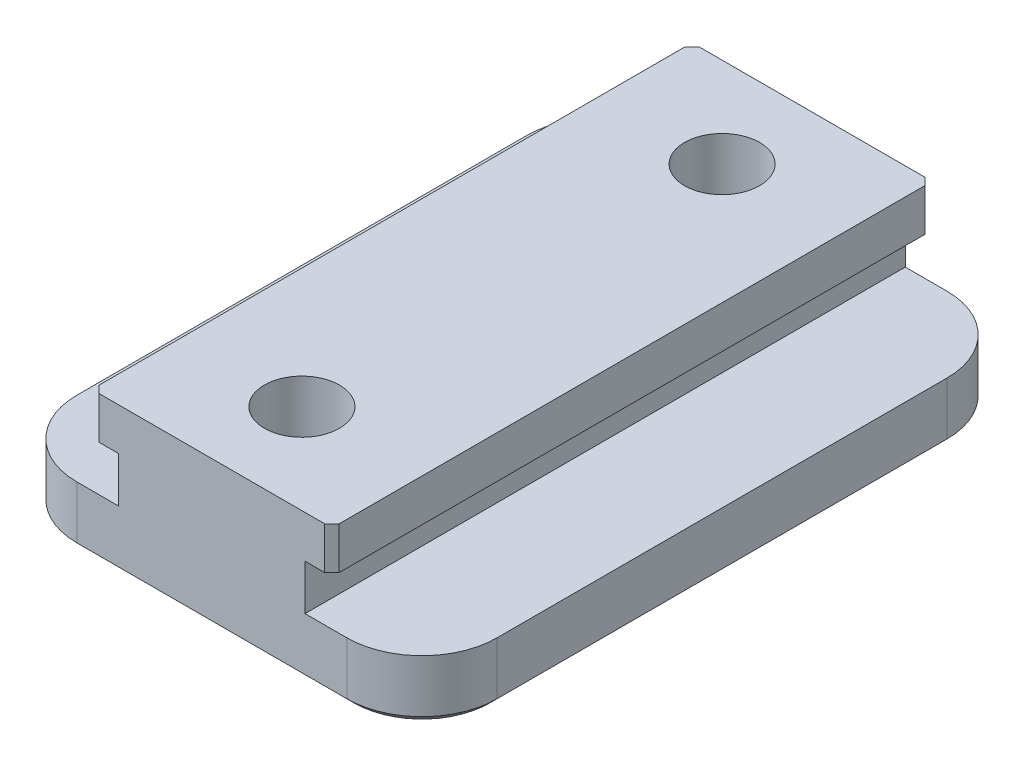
ISO-10303-21;
HEADER;
FILE_DESCRIPTION(('STEP AP214'),'2;1');
FILE_NAME('part.step','',(''),(''),'','','');
FILE_SCHEMA(('AUTOMOTIVE_DESIGN { 1 0 10303 214 1 1 1 1 }'));
ENDSEC;
DATA;
#1=APPLICATION_CONTEXT('core data for automotive mechanical design processes');
#2=APPLICATION_PROTOCOL_DEFINITION('international standard','automotive_design',2000,#1);
#3=PRODUCT_CONTEXT('',#1,'mechanical');
#4=PRODUCT('Part','Part','',(#3));
#5=PRODUCT_RELATED_PRODUCT_CATEGORY('part','',(#4));
#6=PRODUCT_DEFINITION_FORMATION('','',#4);
#7=PRODUCT_DEFINITION_CONTEXT('part definition',#1,'design');
#8=PRODUCT_DEFINITION('design','',#6,#7);
#9=PRODUCT_DEFINITION_SHAPE('','',#8);
#10=(LENGTH_UNIT() NAMED_UNIT(*) SI_UNIT(.MILLI.,.METRE.));
#11=(NAMED_UNIT(*) PLANE_ANGLE_UNIT() SI_UNIT($,.RADIAN.));
#12=(NAMED_UNIT(*) SI_UNIT($,.STERADIAN.) SOLID_ANGLE_UNIT());
#13=UNCERTAINTY_MEASURE_WITH_UNIT(LENGTH_MEASURE(1.E-05),#10,'distance_accuracy_value','');
#14=(GEOMETRIC_REPRESENTATION_CONTEXT(3) GLOBAL_UNCERTAINTY_ASSIGNED_CONTEXT((#13)) GLOBAL_UNIT_ASSIGNED_CONTEXT((#10,
#11,#12)) REPRESENTATION_CONTEXT('',''));
#15=CARTESIAN_POINT('',(0.,0.,0.));
#16=DIRECTION('',(0.,0.,1.));
#17=DIRECTION('',(1.,0.,0.));
#18=AXIS2_PLACEMENT_3D('',#15,#16,#17);
#19=CARTESIAN_POINT('',(-22.225,-9.525,31.75));
#20=DIRECTION('',(0.,1.,0.));
#21=DIRECTION('',(0.,0.,1.));
#22=AXIS2_PLACEMENT_3D('',#19,#20,#21);
#23=PLANE('',#22);
#24=CARTESIAN_POINT('',(0.,-9.525,-22.225));
#25=DIRECTION('',(0.,-1.,0.));
#26=DIRECTION('',(0.,0.,-1.));
#27=AXIS2_PLACEMENT_3D('',#24,#25,#26);
#28=CIRCLE('',#27,3.96875);
#29=CARTESIAN_POINT('',(0.,-9.525,-26.19375));
#30=VERTEX_POINT('',#29);
#31=EDGE_CURVE('E836',#30,#30,#28,.T.);
#32=ORIENTED_EDGE('',*,*,#31,.F.);
#33=EDGE_LOOP('',(#32));
#34=FACE_BOUND('',#33,.T.);
#35=CARTESIAN_POINT('',(-14.2748,-9.525,-23.7998));
#36=DIRECTION('',(0.,1.,0.));
#37=DIRECTION('',(0.,0.,1.));
#38=AXIS2_PLACEMENT_3D('',#35,#36,#37);
#39=CIRCLE('',#38,7.1882);
#40=CARTESIAN_POINT('',(-21.463,-9.525,-23.7998));
#41=VERTEX_POINT('',#40);
#42=CARTESIAN_POINT('',(-14.2748,-9.525,-30.988));
#43=VERTEX_POINT('',#42);
#44=EDGE_CURVE('E318',#41,#43,#39,.F.);
#45=ORIENTED_EDGE('',*,*,#44,.T.);
#46=DIRECTION('',(1.,0.,0.));
#47=VECTOR('',#46,1.);
#48=CARTESIAN_POINT('',(-22.225,-9.525,-30.988));
#49=LINE('',#48,#47);
#50=CARTESIAN_POINT('',(14.2748,-9.525,-30.988));
#51=VERTEX_POINT('',#50);
#52=EDGE_CURVE('E320',#43,#51,#49,.T.);
#53=ORIENTED_EDGE('',*,*,#52,.T.);
#54=CARTESIAN_POINT('',(14.2748,-9.525,-23.7998));
#55=DIRECTION('',(0.,1.,0.));
#56=DIRECTION('',(0.,0.,1.));
#57=AXIS2_PLACEMENT_3D('',#54,#55,#56);
#58=CIRCLE('',#57,7.1882);
#59=CARTESIAN_POINT('',(21.463,-9.525,-23.7998));
#60=VERTEX_POINT('',#59);
#61=EDGE_CURVE('E316',#51,#60,#58,.F.);
#62=ORIENTED_EDGE('',*,*,#61,.T.);
#63=DIRECTION('',(0.,0.,1.));
#64=VECTOR('',#63,1.);
#65=CARTESIAN_POINT('',(21.463,-9.525,31.75));
#66=LINE('',#65,#64);
#67=CARTESIAN_POINT('',(21.463,-9.525,23.7998));
#68=VERTEX_POINT('',#67);
#69=EDGE_CURVE('E312',#60,#68,#66,.T.);
#70=ORIENTED_EDGE('',*,*,#69,.T.);
#71=CARTESIAN_POINT('',(14.2748,-9.525,23.7998));
#72=DIRECTION('',(0.,1.,0.));
#73=DIRECTION('',(0.,0.,1.));
#74=AXIS2_PLACEMENT_3D('',#71,#72,#73);
#75=CIRCLE('',#74,7.1882);
#76=CARTESIAN_POINT('',(14.2748,-9.525,30.988));
#77=VERTEX_POINT('',#76);
#78=EDGE_CURVE('E308',#68,#77,#75,.F.);
#79=ORIENTED_EDGE('',*,*,#78,.T.);
#80=DIRECTION('',(-1.,0.,0.));
#81=VECTOR('',#80,1.);
#82=CARTESIAN_POINT('',(-14.2748,-9.525,30.988));
#83=LINE('',#82,#81);
#84=CARTESIAN_POINT('',(-14.2748,-9.525,30.988));
#85=VERTEX_POINT('',#84);
#86=EDGE_CURVE('E306',#77,#85,#83,.T.);
#87=ORIENTED_EDGE('',*,*,#86,.T.);
#88=CARTESIAN_POINT('',(-14.2748,-9.525,23.7998));
#89=DIRECTION('',(0.,1.,0.));
#90=DIRECTION('',(0.,0.,1.));
#91=AXIS2_PLACEMENT_3D('',#88,#89,#90);
#92=CIRCLE('',#91,7.1882);
#93=CARTESIAN_POINT('',(-21.463,-9.525,23.7998));
#94=VERTEX_POINT('',#93);
#95=EDGE_CURVE('E310',#85,#94,#92,.F.);
#96=ORIENTED_EDGE('',*,*,#95,.T.);
#97=DIRECTION('',(0.,0.,-1.));
#98=VECTOR('',#97,1.);
#99=CARTESIAN_POINT('',(-21.463,-9.525,31.75));
#100=LINE('',#99,#98);
#101=EDGE_CURVE('E314',#94,#41,#100,.T.);
#102=ORIENTED_EDGE('',*,*,#101,.T.);
#103=EDGE_LOOP('',(#45,#53,#62,#70,#79,#87,#96,#102));
#104=FACE_BOUND('',#103,.T.);
#105=CARTESIAN_POINT('',(0.,-9.525,22.225));
#106=DIRECTION('',(0.,-1.,0.));
#107=DIRECTION('',(0.,0.,-1.));
#108=AXIS2_PLACEMENT_3D('',#105,#106,#107);
#109=CIRCLE('',#108,3.96875);
#110=CARTESIAN_POINT('',(0.,-9.525,18.25625));
#111=VERTEX_POINT('',#110);
#112=EDGE_CURVE('E841',#111,#111,#109,.T.);
#113=ORIENTED_EDGE('',*,*,#112,.F.);
#114=EDGE_LOOP('',(#113));
#115=FACE_BOUND('',#114,.T.);
#116=ADVANCED_FACE('F39',(#34,#104,#115),#23,.F.);
#117=CARTESIAN_POINT('',(-12.7,6.096,31.75));
#118=DIRECTION('',(1.,0.,0.));
#119=DIRECTION('',(0.,0.,-1.));
#120=AXIS2_PLACEMENT_3D('',#117,#118,#119);
#121=PLANE('',#120);
#122=DIRECTION('',(0.,0.,-1.));
#123=VECTOR('',#122,1.);
#124=CARTESIAN_POINT('',(-12.7,6.096,31.75));
#125=LINE('',#124,#123);
#126=CARTESIAN_POINT('',(-12.7,6.096,30.988));
#127=VERTEX_POINT('',#126);
#128=CARTESIAN_POINT('',(-12.7,6.096,-30.988));
#129=VERTEX_POINT('',#128);
#130=EDGE_CURVE('E239',#127,#129,#125,.T.);
#131=ORIENTED_EDGE('',*,*,#130,.T.);
#132=DIRECTION('',(0.,-1.,0.));
#133=VECTOR('',#132,1.);
#134=CARTESIAN_POINT('',(-12.7,6.096,-30.988));
#135=LINE('',#134,#133);
#136=CARTESIAN_POINT('',(-12.7,1.6256,-30.988));
#137=VERTEX_POINT('',#136);
#138=EDGE_CURVE('E385',#129,#137,#135,.T.);
#139=ORIENTED_EDGE('',*,*,#138,.T.);
#140=DIRECTION('',(0.,0.,-1.));
#141=VECTOR('',#140,1.);
#142=CARTESIAN_POINT('',(-12.7,1.6256,31.75));
#143=LINE('',#142,#141);
#144=CARTESIAN_POINT('',(-12.7,1.6256,30.988));
#145=VERTEX_POINT('',#144);
#146=EDGE_CURVE('E219',#145,#137,#143,.T.);
#147=ORIENTED_EDGE('',*,*,#146,.F.);
#148=DIRECTION('',(0.,1.,0.));
#149=VECTOR('',#148,1.);
#150=CARTESIAN_POINT('',(-12.7,6.096,30.988));
#151=LINE('',#150,#149);
#152=EDGE_CURVE('E383',#145,#127,#151,.T.);
#153=ORIENTED_EDGE('',*,*,#152,.T.);
#154=EDGE_LOOP('',(#131,#139,#147,#153));
#155=FACE_BOUND('',#154,.T.);
#156=ADVANCED_FACE('F402',(#155),#121,.F.);
#157=CARTESIAN_POINT('',(-12.7,1.6256,31.75));
#158=DIRECTION('',(0.,1.,0.));
#159=DIRECTION('',(-1.,0.,0.));
#160=AXIS2_PLACEMENT_3D('',#157,#158,#159);
#161=PLANE('',#160);
#162=ORIENTED_EDGE('',*,*,#146,.T.);
#163=DIRECTION('',(-0.707106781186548,0.,0.707106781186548));
#164=VECTOR('',#163,1.);
#165=CARTESIAN_POINT('',(-12.7,1.6256,-30.988));
#166=LINE('',#165,#164);
#167=CARTESIAN_POINT('',(-11.938,1.6256,-31.75));
#168=VERTEX_POINT('',#167);
#169=EDGE_CURVE('E61',#137,#168,#166,.F.);
#170=ORIENTED_EDGE('',*,*,#169,.T.);
#171=DIRECTION('',(1.,0.,0.));
#172=VECTOR('',#171,1.);
#173=CARTESIAN_POINT('',(-12.7,1.6256,-31.75));
#174=LINE('',#173,#172);
#175=CARTESIAN_POINT('',(-9.8552,1.6256,-31.75));
#176=VERTEX_POINT('',#175);
#177=EDGE_CURVE('E216',#168,#176,#174,.T.);
#178=ORIENTED_EDGE('',*,*,#177,.T.);
#179=DIRECTION('',(0.,0.,-1.));
#180=VECTOR('',#179,1.);
#181=CARTESIAN_POINT('',(-9.8552,1.6256,31.75));
#182=LINE('',#181,#180);
#183=CARTESIAN_POINT('',(-9.8552,1.6256,31.75));
#184=VERTEX_POINT('',#183);
#185=EDGE_CURVE('E212',#184,#176,#182,.T.);
#186=ORIENTED_EDGE('',*,*,#185,.F.);
#187=DIRECTION('',(1.,0.,0.));
#188=VECTOR('',#187,1.);
#189=CARTESIAN_POINT('',(-12.7,1.6256,31.75));
#190=LINE('',#189,#188);
#191=CARTESIAN_POINT('',(-11.938,1.6256,31.75));
#192=VERTEX_POINT('',#191);
#193=EDGE_CURVE('E200',#192,#184,#190,.T.);
#194=ORIENTED_EDGE('',*,*,#193,.F.);
#195=DIRECTION('',(-0.707106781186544,0.,-0.707106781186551));
#196=VECTOR('',#195,1.);
#197=CARTESIAN_POINT('',(-11.938,1.6256,31.75));
#198=LINE('',#197,#196);
#199=EDGE_CURVE('E54',#192,#145,#198,.T.);
#200=ORIENTED_EDGE('',*,*,#199,.T.);
#201=EDGE_LOOP('',(#162,#170,#178,#186,#194,#200));
#202=FACE_BOUND('',#201,.T.);
#203=ADVANCED_FACE('F214',(#202),#161,.F.);
#204=CARTESIAN_POINT('',(-9.8552,1.6256,31.75));
#205=DIRECTION('',(1.,0.,0.));
#206=DIRECTION('',(0.,1.,0.));
#207=AXIS2_PLACEMENT_3D('',#204,#205,#206);
#208=PLANE('',#207);
#209=DIRECTION('',(0.,-1.,0.));
#210=VECTOR('',#209,1.);
#211=CARTESIAN_POINT('',(-9.8552,1.6256,-31.75));
#212=LINE('',#211,#210);
#213=CARTESIAN_POINT('',(-9.8552,-3.175,-31.75));
#214=VERTEX_POINT('',#213);
#215=EDGE_CURVE('E241',#176,#214,#212,.T.);
#216=ORIENTED_EDGE('',*,*,#215,.T.);
#217=DIRECTION('',(0.,0.,-1.));
#218=VECTOR('',#217,1.);
#219=CARTESIAN_POINT('',(-9.8552,-3.175,31.75));
#220=LINE('',#219,#218);
#221=CARTESIAN_POINT('',(-9.8552,-3.175,31.75));
#222=VERTEX_POINT('',#221);
#223=EDGE_CURVE('E220',#222,#214,#220,.T.);
#224=ORIENTED_EDGE('',*,*,#223,.F.);
#225=DIRECTION('',(0.,-1.,0.));
#226=VECTOR('',#225,1.);
#227=CARTESIAN_POINT('',(-9.8552,1.6256,31.75));
#228=LINE('',#227,#226);
#229=EDGE_CURVE('E206',#184,#222,#228,.T.);
#230=ORIENTED_EDGE('',*,*,#229,.F.);
#231=ORIENTED_EDGE('',*,*,#185,.T.);
#232=EDGE_LOOP('',(#216,#224,#230,#231));
#233=FACE_BOUND('',#232,.T.);
#234=ADVANCED_FACE('F222',(#233),#208,.F.);
#235=CARTESIAN_POINT('',(-9.8552,-3.175,31.75));
#236=DIRECTION('',(0.,-1.,0.));
#237=DIRECTION('',(1.,0.,0.));
#238=AXIS2_PLACEMENT_3D('',#235,#236,#237);
#239=PLANE('',#238);
#240=DIRECTION('',(0.,0.,-1.));
#241=VECTOR('',#240,1.);
#242=CARTESIAN_POINT('',(-22.225,-3.175,31.75));
#243=LINE('',#242,#241);
#244=CARTESIAN_POINT('',(-22.225,-3.175,23.7998));
#245=VERTEX_POINT('',#244);
#246=CARTESIAN_POINT('',(-22.225,-3.175,-23.7998));
#247=VERTEX_POINT('',#246);
#248=EDGE_CURVE('E273',#245,#247,#243,.T.);
#249=ORIENTED_EDGE('',*,*,#248,.F.);
#250=CARTESIAN_POINT('',(-14.2748,-3.175,23.7998));
#251=DIRECTION('',(0.,-1.,0.));
#252=DIRECTION('',(1.,0.,0.));
#253=AXIS2_PLACEMENT_3D('',#250,#251,#252);
#254=CIRCLE('',#253,7.9502);
#255=CARTESIAN_POINT('',(-14.2748,-3.175,31.75));
#256=VERTEX_POINT('',#255);
#257=EDGE_CURVE('E290',#245,#256,#254,.F.);
#258=ORIENTED_EDGE('',*,*,#257,.T.);
#259=DIRECTION('',(-1.,0.,0.));
#260=VECTOR('',#259,1.);
#261=CARTESIAN_POINT('',(-9.8552,-3.175,31.75));
#262=LINE('',#261,#260);
#263=EDGE_CURVE('E225',#222,#256,#262,.T.);
#264=ORIENTED_EDGE('',*,*,#263,.F.);
#265=ORIENTED_EDGE('',*,*,#223,.T.);
#266=DIRECTION('',(-1.,0.,0.));
#267=VECTOR('',#266,1.);
#268=CARTESIAN_POINT('',(-9.8552,-3.175,-31.75));
#269=LINE('',#268,#267);
#270=CARTESIAN_POINT('',(-14.2748,-3.175,-31.75));
#271=VERTEX_POINT('',#270);
#272=EDGE_CURVE('E244',#214,#271,#269,.T.);
#273=ORIENTED_EDGE('',*,*,#272,.T.);
#274=CARTESIAN_POINT('',(-14.2748,-3.175,-23.7998));
#275=DIRECTION('',(0.,-1.,0.));
#276=DIRECTION('',(1.,0.,0.));
#277=AXIS2_PLACEMENT_3D('',#274,#275,#276);
#278=CIRCLE('',#277,7.9502);
#279=EDGE_CURVE('E288',#271,#247,#278,.F.);
#280=ORIENTED_EDGE('',*,*,#279,.T.);
#281=EDGE_LOOP('',(#249,#258,#264,#265,#273,#280));
#282=FACE_BOUND('',#281,.T.);
#283=ADVANCED_FACE('F520',(#282),#239,.F.);
#284=CARTESIAN_POINT('',(-22.225,-3.175,31.75));
#285=DIRECTION('',(1.,0.,0.));
#286=DIRECTION('',(0.,0.,-1.));
#287=AXIS2_PLACEMENT_3D('',#284,#285,#286);
#288=PLANE('',#287);
#289=DIRECTION('',(0.,-1.,0.));
#290=VECTOR('',#289,1.);
#291=CARTESIAN_POINT('',(-22.225,-3.175,-23.7998));
#292=LINE('',#291,#290);
#293=CARTESIAN_POINT('',(-22.225,-8.763,-23.7998));
#294=VERTEX_POINT('',#293);
#295=EDGE_CURVE('E283',#247,#294,#292,.T.);
#296=ORIENTED_EDGE('',*,*,#295,.T.);
#297=DIRECTION('',(0.,0.,1.));
#298=VECTOR('',#297,1.);
#299=CARTESIAN_POINT('',(-22.225,-8.763,31.75));
#300=LINE('',#299,#298);
#301=CARTESIAN_POINT('',(-22.225,-8.763,23.7998));
#302=VERTEX_POINT('',#301);
#303=EDGE_CURVE('E330',#294,#302,#300,.T.);
#304=ORIENTED_EDGE('',*,*,#303,.T.);
#305=DIRECTION('',(0.,-1.,0.));
#306=VECTOR('',#305,1.);
#307=CARTESIAN_POINT('',(-22.225,-3.175,23.7998));
#308=LINE('',#307,#306);
#309=EDGE_CURVE('E286',#302,#245,#308,.F.);
#310=ORIENTED_EDGE('',*,*,#309,.T.);
#311=ORIENTED_EDGE('',*,*,#248,.T.);
#312=EDGE_LOOP('',(#296,#304,#310,#311));
#313=FACE_BOUND('',#312,.T.);
#314=ADVANCED_FACE('F464',(#313),#288,.F.);
#315=CARTESIAN_POINT('',(22.225,-3.175,31.75));
#316=DIRECTION('',(-1.,0.,0.));
#317=DIRECTION('',(0.,0.,1.));
#318=AXIS2_PLACEMENT_3D('',#315,#316,#317);
#319=PLANE('',#318);
#320=DIRECTION('',(0.,1.,0.));
#321=VECTOR('',#320,1.);
#322=CARTESIAN_POINT('',(22.225,-9.525,23.7998));
#323=LINE('',#322,#321);
#324=CARTESIAN_POINT('',(22.225,-3.175,23.7998));
#325=VERTEX_POINT('',#324);
#326=CARTESIAN_POINT('',(22.225,-8.763,23.7998));
#327=VERTEX_POINT('',#326);
#328=EDGE_CURVE('E297',#325,#327,#323,.F.);
#329=ORIENTED_EDGE('',*,*,#328,.T.);
#330=DIRECTION('',(0.,0.,-1.));
#331=VECTOR('',#330,1.);
#332=CARTESIAN_POINT('',(22.225,-8.763,31.75));
#333=LINE('',#332,#331);
#334=CARTESIAN_POINT('',(22.225,-8.763,-23.7998));
#335=VERTEX_POINT('',#334);
#336=EDGE_CURVE('E332',#327,#335,#333,.T.);
#337=ORIENTED_EDGE('',*,*,#336,.T.);
#338=DIRECTION('',(0.,1.,0.));
#339=VECTOR('',#338,1.);
#340=CARTESIAN_POINT('',(22.225,-3.175,-23.7998));
#341=LINE('',#340,#339);
#342=CARTESIAN_POINT('',(22.225,-3.175,-23.7998));
#343=VERTEX_POINT('',#342);
#344=EDGE_CURVE('E300',#335,#343,#341,.T.);
#345=ORIENTED_EDGE('',*,*,#344,.T.);
#346=DIRECTION('',(0.,0.,-1.));
#347=VECTOR('',#346,1.);
#348=CARTESIAN_POINT('',(22.225,-3.175,31.75));
#349=LINE('',#348,#347);
#350=EDGE_CURVE('E270',#325,#343,#349,.T.);
#351=ORIENTED_EDGE('',*,*,#350,.F.);
#352=EDGE_LOOP('',(#329,#337,#345,#351));
#353=FACE_BOUND('',#352,.T.);
#354=ADVANCED_FACE('F496',(#353),#319,.F.);
#355=CARTESIAN_POINT('',(9.8552,-3.175,31.75));
#356=DIRECTION('',(0.,-1.,0.));
#357=DIRECTION('',(1.,0.,0.));
#358=AXIS2_PLACEMENT_3D('',#355,#356,#357);
#359=PLANE('',#358);
#360=ORIENTED_EDGE('',*,*,#350,.T.);
#361=CARTESIAN_POINT('',(14.2748,-3.175,-23.7998));
#362=DIRECTION('',(0.,-1.,0.));
#363=DIRECTION('',(1.,0.,0.));
#364=AXIS2_PLACEMENT_3D('',#361,#362,#363);
#365=CIRCLE('',#364,7.9502);
#366=CARTESIAN_POINT('',(14.2748,-3.175,-31.75));
#367=VERTEX_POINT('',#366);
#368=EDGE_CURVE('E304',#343,#367,#365,.F.);
#369=ORIENTED_EDGE('',*,*,#368,.T.);
#370=DIRECTION('',(-1.,0.,0.));
#371=VECTOR('',#370,1.);
#372=CARTESIAN_POINT('',(9.8552,-3.175,-31.75));
#373=LINE('',#372,#371);
#374=CARTESIAN_POINT('',(9.8552,-3.175,-31.75));
#375=VERTEX_POINT('',#374);
#376=EDGE_CURVE('E247',#367,#375,#373,.T.);
#377=ORIENTED_EDGE('',*,*,#376,.T.);
#378=DIRECTION('',(0.,0.,-1.));
#379=VECTOR('',#378,1.);
#380=CARTESIAN_POINT('',(9.8552,-3.175,31.75));
#381=LINE('',#380,#379);
#382=CARTESIAN_POINT('',(9.8552,-3.175,31.75));
#383=VERTEX_POINT('',#382);
#384=EDGE_CURVE('E267',#383,#375,#381,.T.);
#385=ORIENTED_EDGE('',*,*,#384,.F.);
#386=DIRECTION('',(-1.,0.,0.));
#387=VECTOR('',#386,1.);
#388=CARTESIAN_POINT('',(9.8552,-3.175,31.75));
#389=LINE('',#388,#387);
#390=CARTESIAN_POINT('',(14.2748,-3.175,31.75));
#391=VERTEX_POINT('',#390);
#392=EDGE_CURVE('E227',#391,#383,#389,.T.);
#393=ORIENTED_EDGE('',*,*,#392,.F.);
#394=CARTESIAN_POINT('',(14.2748,-3.175,23.7998));
#395=DIRECTION('',(0.,-1.,0.));
#396=DIRECTION('',(1.,0.,0.));
#397=AXIS2_PLACEMENT_3D('',#394,#395,#396);
#398=CIRCLE('',#397,7.9502);
#399=EDGE_CURVE('E302',#391,#325,#398,.F.);
#400=ORIENTED_EDGE('',*,*,#399,.T.);
#401=EDGE_LOOP('',(#360,#369,#377,#385,#393,#400));
#402=FACE_BOUND('',#401,.T.);
#403=ADVANCED_FACE('F431',(#402),#359,.F.);
#404=CARTESIAN_POINT('',(9.8552,1.6256,31.75));
#405=DIRECTION('',(-1.,0.,0.));
#406=DIRECTION('',(0.,-1.,0.));
#407=AXIS2_PLACEMENT_3D('',#404,#405,#406);
#408=PLANE('',#407);
#409=DIRECTION('',(0.,1.,0.));
#410=VECTOR('',#409,1.);
#411=CARTESIAN_POINT('',(9.8552,1.6256,-31.75));
#412=LINE('',#411,#410);
#413=CARTESIAN_POINT('',(9.8552,1.6256,-31.75));
#414=VERTEX_POINT('',#413);
#415=EDGE_CURVE('E249',#375,#414,#412,.T.);
#416=ORIENTED_EDGE('',*,*,#415,.T.);
#417=DIRECTION('',(0.,0.,-1.));
#418=VECTOR('',#417,1.);
#419=CARTESIAN_POINT('',(9.8552,1.6256,31.75));
#420=LINE('',#419,#418);
#421=CARTESIAN_POINT('',(9.8552,1.6256,31.75));
#422=VERTEX_POINT('',#421);
#423=EDGE_CURVE('E264',#422,#414,#420,.T.);
#424=ORIENTED_EDGE('',*,*,#423,.F.);
#425=DIRECTION('',(0.,1.,0.));
#426=VECTOR('',#425,1.);
#427=CARTESIAN_POINT('',(9.8552,1.6256,31.75));
#428=LINE('',#427,#426);
#429=EDGE_CURVE('E232',#383,#422,#428,.T.);
#430=ORIENTED_EDGE('',*,*,#429,.F.);
#431=ORIENTED_EDGE('',*,*,#384,.T.);
#432=EDGE_LOOP('',(#416,#424,#430,#431));
#433=FACE_BOUND('',#432,.T.);
#434=ADVANCED_FACE('F427',(#433),#408,.F.);
#435=CARTESIAN_POINT('',(12.7,1.6256,31.75));
#436=DIRECTION('',(0.,1.,0.));
#437=DIRECTION('',(0.,0.,1.));
#438=AXIS2_PLACEMENT_3D('',#435,#436,#437);
#439=PLANE('',#438);
#440=DIRECTION('',(1.,0.,0.));
#441=VECTOR('',#440,1.);
#442=CARTESIAN_POINT('',(12.7,1.6256,-31.75));
#443=LINE('',#442,#441);
#444=CARTESIAN_POINT('',(11.938,1.6256,-31.75));
#445=VERTEX_POINT('',#444);
#446=EDGE_CURVE('E251',#414,#445,#443,.T.);
#447=ORIENTED_EDGE('',*,*,#446,.T.);
#448=DIRECTION('',(-0.707106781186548,0.,-0.707106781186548));
#449=VECTOR('',#448,1.);
#450=CARTESIAN_POINT('',(12.7,1.6256,-30.988));
#451=LINE('',#450,#449);
#452=CARTESIAN_POINT('',(12.7,1.6256,-30.988));
#453=VERTEX_POINT('',#452);
#454=EDGE_CURVE('E381',#445,#453,#451,.F.);
#455=ORIENTED_EDGE('',*,*,#454,.T.);
#456=DIRECTION('',(0.,0.,-1.));
#457=VECTOR('',#456,1.);
#458=CARTESIAN_POINT('',(12.7,1.6256,31.75));
#459=LINE('',#458,#457);
#460=CARTESIAN_POINT('',(12.7,1.6256,30.988));
#461=VERTEX_POINT('',#460);
#462=EDGE_CURVE('E261',#461,#453,#459,.T.);
#463=ORIENTED_EDGE('',*,*,#462,.F.);
#464=DIRECTION('',(-0.707106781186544,0.,0.707106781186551));
#465=VECTOR('',#464,1.);
#466=CARTESIAN_POINT('',(11.938,1.6256,31.75));
#467=LINE('',#466,#465);
#468=CARTESIAN_POINT('',(11.938,1.6256,31.75));
#469=VERTEX_POINT('',#468);
#470=EDGE_CURVE('E379',#461,#469,#467,.T.);
#471=ORIENTED_EDGE('',*,*,#470,.T.);
#472=DIRECTION('',(1.,0.,0.));
#473=VECTOR('',#472,1.);
#474=CARTESIAN_POINT('',(12.7,1.6256,31.75));
#475=LINE('',#474,#473);
#476=EDGE_CURVE('E234',#422,#469,#475,.T.);
#477=ORIENTED_EDGE('',*,*,#476,.F.);
#478=ORIENTED_EDGE('',*,*,#423,.T.);
#479=EDGE_LOOP('',(#447,#455,#463,#471,#477,#478));
#480=FACE_BOUND('',#479,.T.);
#481=ADVANCED_FACE('F417',(#480),#439,.F.);
#482=CARTESIAN_POINT('',(12.7,6.096,31.75));
#483=DIRECTION('',(-1.,0.,0.));
#484=DIRECTION('',(0.,0.,1.));
#485=AXIS2_PLACEMENT_3D('',#482,#483,#484);
#486=PLANE('',#485);
#487=ORIENTED_EDGE('',*,*,#462,.T.);
#488=DIRECTION('',(0.,1.,0.));
#489=VECTOR('',#488,1.);
#490=CARTESIAN_POINT('',(12.7,6.096,-30.988));
#491=LINE('',#490,#489);
#492=CARTESIAN_POINT('',(12.7,6.096,-30.988));
#493=VERTEX_POINT('',#492);
#494=EDGE_CURVE('E364',#453,#493,#491,.T.);
#495=ORIENTED_EDGE('',*,*,#494,.T.);
#496=DIRECTION('',(0.,0.,-1.));
#497=VECTOR('',#496,1.);
#498=CARTESIAN_POINT('',(12.7,6.096,31.75));
#499=LINE('',#498,#497);
#500=CARTESIAN_POINT('',(12.7,6.096,30.988));
#501=VERTEX_POINT('',#500);
#502=EDGE_CURVE('E258',#501,#493,#499,.T.);
#503=ORIENTED_EDGE('',*,*,#502,.F.);
#504=DIRECTION('',(0.,-1.,0.));
#505=VECTOR('',#504,1.);
#506=CARTESIAN_POINT('',(12.7,1.6256,30.988));
#507=LINE('',#506,#505);
#508=EDGE_CURVE('E340',#501,#461,#507,.T.);
#509=ORIENTED_EDGE('',*,*,#508,.T.);
#510=EDGE_LOOP('',(#487,#495,#503,#509));
#511=FACE_BOUND('',#510,.T.);
#512=ADVANCED_FACE('F419',(#511),#486,.F.);
#513=CARTESIAN_POINT('',(12.7,6.096,31.75));
#514=DIRECTION('',(0.,-1.,0.));
#515=DIRECTION('',(0.,0.,-1.));
#516=AXIS2_PLACEMENT_3D('',#513,#514,#515);
#517=PLANE('',#516);
#518=CARTESIAN_POINT('',(0.,6.096,22.225));
#519=DIRECTION('',(0.,-1.,0.));
#520=DIRECTION('',(0.,0.,-1.));
#521=AXIS2_PLACEMENT_3D('',#518,#519,#520);
#522=CIRCLE('',#521,3.96875);
#523=CARTESIAN_POINT('',(0.,6.096,18.25625));
#524=VERTEX_POINT('',#523);
#525=EDGE_CURVE('E833',#524,#524,#522,.T.);
#526=ORIENTED_EDGE('',*,*,#525,.T.);
#527=EDGE_LOOP('',(#526));
#528=FACE_BOUND('',#527,.T.);
#529=CARTESIAN_POINT('',(0.,6.096,-22.225));
#530=DIRECTION('',(0.,-1.,0.));
#531=DIRECTION('',(0.,0.,-1.));
#532=AXIS2_PLACEMENT_3D('',#529,#530,#531);
#533=CIRCLE('',#532,3.96875);
#534=CARTESIAN_POINT('',(0.,6.096,-26.19375));
#535=VERTEX_POINT('',#534);
#536=EDGE_CURVE('E344',#535,#535,#533,.T.);
#537=ORIENTED_EDGE('',*,*,#536,.T.);
#538=EDGE_LOOP('',(#537));
#539=FACE_BOUND('',#538,.T.);
#540=ORIENTED_EDGE('',*,*,#502,.T.);
#541=DIRECTION('',(0.707106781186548,0.,0.707106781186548));
#542=VECTOR('',#541,1.);
#543=CARTESIAN_POINT('',(12.7,6.096,-30.988));
#544=LINE('',#543,#542);
#545=CARTESIAN_POINT('',(11.938,6.096,-31.75));
#546=VERTEX_POINT('',#545);
#547=EDGE_CURVE('E373',#493,#546,#544,.F.);
#548=ORIENTED_EDGE('',*,*,#547,.T.);
#549=DIRECTION('',(-1.,0.,0.));
#550=VECTOR('',#549,1.);
#551=CARTESIAN_POINT('',(12.7,6.096,-31.75));
#552=LINE('',#551,#550);
#553=CARTESIAN_POINT('',(-11.938,6.096,-31.75));
#554=VERTEX_POINT('',#553);
#555=EDGE_CURVE('E209',#546,#554,#552,.T.);
#556=ORIENTED_EDGE('',*,*,#555,.T.);
#557=DIRECTION('',(0.707106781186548,0.,-0.707106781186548));
#558=VECTOR('',#557,1.);
#559=CARTESIAN_POINT('',(-12.7,6.096,-30.988));
#560=LINE('',#559,#558);
#561=EDGE_CURVE('E371',#554,#129,#560,.F.);
#562=ORIENTED_EDGE('',*,*,#561,.T.);
#563=ORIENTED_EDGE('',*,*,#130,.F.);
#564=DIRECTION('',(0.707106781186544,0.,0.707106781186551));
#565=VECTOR('',#564,1.);
#566=CARTESIAN_POINT('',(-11.938,6.096,31.75));
#567=LINE('',#566,#565);
#568=CARTESIAN_POINT('',(-11.938,6.096,31.75));
#569=VERTEX_POINT('',#568);
#570=EDGE_CURVE('E369',#127,#569,#567,.T.);
#571=ORIENTED_EDGE('',*,*,#570,.T.);
#572=DIRECTION('',(-1.,0.,0.));
#573=VECTOR('',#572,1.);
#574=CARTESIAN_POINT('',(12.7,6.096,31.75));
#575=LINE('',#574,#573);
#576=CARTESIAN_POINT('',(11.938,6.096,31.75));
#577=VERTEX_POINT('',#576);
#578=EDGE_CURVE('E237',#577,#569,#575,.T.);
#579=ORIENTED_EDGE('',*,*,#578,.F.);
#580=DIRECTION('',(0.707106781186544,0.,-0.707106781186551));
#581=VECTOR('',#580,1.);
#582=CARTESIAN_POINT('',(11.938,6.096,31.75));
#583=LINE('',#582,#581);
#584=EDGE_CURVE('E367',#577,#501,#583,.T.);
#585=ORIENTED_EDGE('',*,*,#584,.T.);
#586=EDGE_LOOP('',(#540,#548,#556,#562,#563,#571,#579,#585));
#587=FACE_BOUND('',#586,.T.);
#588=ADVANCED_FACE('F395',(#528,#539,#587),#517,.F.);
#589=CARTESIAN_POINT('',(0.,0.,31.75));
#590=DIRECTION('',(0.,0.,1.));
#591=DIRECTION('',(1.,0.,0.));
#592=AXIS2_PLACEMENT_3D('',#589,#590,#591);
#593=PLANE('',#592);
#594=ORIENTED_EDGE('',*,*,#578,.T.);
#595=DIRECTION('',(0.,-1.,0.));
#596=VECTOR('',#595,1.);
#597=CARTESIAN_POINT('',(-11.938,1.6256,31.75));
#598=LINE('',#597,#596);
#599=EDGE_CURVE('E11',#569,#192,#598,.T.);
#600=ORIENTED_EDGE('',*,*,#599,.T.);
#601=ORIENTED_EDGE('',*,*,#193,.T.);
#602=ORIENTED_EDGE('',*,*,#229,.T.);
#603=ORIENTED_EDGE('',*,*,#263,.T.);
#604=DIRECTION('',(0.,-1.,0.));
#605=VECTOR('',#604,1.);
#606=CARTESIAN_POINT('',(-14.2748,-9.525,31.75));
#607=LINE('',#606,#605);
#608=CARTESIAN_POINT('',(-14.2748,-8.763,31.75));
#609=VERTEX_POINT('',#608);
#610=EDGE_CURVE('E280',#256,#609,#607,.T.);
#611=ORIENTED_EDGE('',*,*,#610,.T.);
#612=DIRECTION('',(1.,0.,0.));
#613=VECTOR('',#612,1.);
#614=CARTESIAN_POINT('',(14.2748,-8.763,31.75));
#615=LINE('',#614,#613);
#616=CARTESIAN_POINT('',(14.2748,-8.763,31.75));
#617=VERTEX_POINT('',#616);
#618=EDGE_CURVE('E338',#609,#617,#615,.T.);
#619=ORIENTED_EDGE('',*,*,#618,.T.);
#620=DIRECTION('',(0.,1.,0.));
#621=VECTOR('',#620,1.);
#622=CARTESIAN_POINT('',(14.2748,-3.175,31.75));
#623=LINE('',#622,#621);
#624=EDGE_CURVE('E278',#617,#391,#623,.T.);
#625=ORIENTED_EDGE('',*,*,#624,.T.);
#626=ORIENTED_EDGE('',*,*,#392,.T.);
#627=ORIENTED_EDGE('',*,*,#429,.T.);
#628=ORIENTED_EDGE('',*,*,#476,.T.);
#629=DIRECTION('',(0.,1.,0.));
#630=VECTOR('',#629,1.);
#631=CARTESIAN_POINT('',(11.938,6.096,31.75));
#632=LINE('',#631,#630);
#633=EDGE_CURVE('E47',#469,#577,#632,.T.);
#634=ORIENTED_EDGE('',*,*,#633,.T.);
#635=EDGE_LOOP('',(#594,#600,#601,#602,#603,#611,#619,#625,#626,#627,#628,#634));
#636=FACE_BOUND('',#635,.T.);
#637=ADVANCED_FACE('F203',(#636),#593,.T.);
#638=CARTESIAN_POINT('',(0.,0.,-31.75));
#639=DIRECTION('',(0.,0.,1.));
#640=DIRECTION('',(1.,0.,0.));
#641=AXIS2_PLACEMENT_3D('',#638,#639,#640);
#642=PLANE('',#641);
#643=ORIENTED_EDGE('',*,*,#555,.F.);
#644=DIRECTION('',(0.,-1.,0.));
#645=VECTOR('',#644,1.);
#646=CARTESIAN_POINT('',(11.938,0.,-31.75));
#647=LINE('',#646,#645);
#648=EDGE_CURVE('E377',#546,#445,#647,.T.);
#649=ORIENTED_EDGE('',*,*,#648,.T.);
#650=ORIENTED_EDGE('',*,*,#446,.F.);
#651=ORIENTED_EDGE('',*,*,#415,.F.);
#652=ORIENTED_EDGE('',*,*,#376,.F.);
#653=DIRECTION('',(0.,1.,0.));
#654=VECTOR('',#653,1.);
#655=CARTESIAN_POINT('',(14.2748,0.,-31.75));
#656=LINE('',#655,#654);
#657=CARTESIAN_POINT('',(14.2748,-8.763,-31.75));
#658=VERTEX_POINT('',#657);
#659=EDGE_CURVE('E292',#367,#658,#656,.F.);
#660=ORIENTED_EDGE('',*,*,#659,.T.);
#661=DIRECTION('',(-1.,0.,0.));
#662=VECTOR('',#661,1.);
#663=CARTESIAN_POINT('',(0.,-8.763,-31.75));
#664=LINE('',#663,#662);
#665=CARTESIAN_POINT('',(-14.2748,-8.763,-31.75));
#666=VERTEX_POINT('',#665);
#667=EDGE_CURVE('E323',#658,#666,#664,.T.);
#668=ORIENTED_EDGE('',*,*,#667,.T.);
#669=DIRECTION('',(0.,-1.,0.));
#670=VECTOR('',#669,1.);
#671=CARTESIAN_POINT('',(-14.2748,0.,-31.75));
#672=LINE('',#671,#670);
#673=EDGE_CURVE('E295',#666,#271,#672,.F.);
#674=ORIENTED_EDGE('',*,*,#673,.T.);
#675=ORIENTED_EDGE('',*,*,#272,.F.);
#676=ORIENTED_EDGE('',*,*,#215,.F.);
#677=ORIENTED_EDGE('',*,*,#177,.F.);
#678=DIRECTION('',(0.,1.,0.));
#679=VECTOR('',#678,1.);
#680=CARTESIAN_POINT('',(-11.938,0.,-31.75));
#681=LINE('',#680,#679);
#682=EDGE_CURVE('E375',#168,#554,#681,.T.);
#683=ORIENTED_EDGE('',*,*,#682,.T.);
#684=EDGE_LOOP('',(#643,#649,#650,#651,#652,#660,#668,#674,#675,#676,#677,#683));
#685=FACE_BOUND('',#684,.T.);
#686=ADVANCED_FACE('F405',(#685),#642,.F.);
#687=CARTESIAN_POINT('',(-14.2748,0.,23.7998));
#688=DIRECTION('',(0.,1.,0.));
#689=DIRECTION('',(0.,0.,1.));
#690=AXIS2_PLACEMENT_3D('',#687,#688,#689);
#691=CYLINDRICAL_SURFACE('',#690,7.9502);
#692=ORIENTED_EDGE('',*,*,#309,.F.);
#693=CARTESIAN_POINT('',(-14.2748,-8.763,23.7998));
#694=DIRECTION('',(0.,1.,0.));
#695=DIRECTION('',(0.,0.,1.));
#696=AXIS2_PLACEMENT_3D('',#693,#694,#695);
#697=CIRCLE('',#696,7.9502);
#698=EDGE_CURVE('E334',#302,#609,#697,.T.);
#699=ORIENTED_EDGE('',*,*,#698,.T.);
#700=ORIENTED_EDGE('',*,*,#610,.F.);
#701=ORIENTED_EDGE('',*,*,#257,.F.);
#702=EDGE_LOOP('',(#692,#699,#700,#701));
#703=FACE_BOUND('',#702,.T.);
#704=ADVANCED_FACE('F477',(#703),#691,.T.);
#705=CARTESIAN_POINT('',(-14.2748,-3.175,-23.7998));
#706=DIRECTION('',(0.,-1.,0.));
#707=DIRECTION('',(0.,0.,-1.));
#708=AXIS2_PLACEMENT_3D('',#705,#706,#707);
#709=CYLINDRICAL_SURFACE('',#708,7.9502);
#710=ORIENTED_EDGE('',*,*,#673,.F.);
#711=CARTESIAN_POINT('',(-14.2748,-8.763,-23.7998));
#712=DIRECTION('',(0.,1.,0.));
#713=DIRECTION('',(0.,0.,1.));
#714=AXIS2_PLACEMENT_3D('',#711,#712,#713);
#715=CIRCLE('',#714,7.9502);
#716=EDGE_CURVE('E326',#666,#294,#715,.T.);
#717=ORIENTED_EDGE('',*,*,#716,.T.);
#718=ORIENTED_EDGE('',*,*,#295,.F.);
#719=ORIENTED_EDGE('',*,*,#279,.F.);
#720=EDGE_LOOP('',(#710,#717,#718,#719));
#721=FACE_BOUND('',#720,.T.);
#722=ADVANCED_FACE('F460',(#721),#709,.T.);
#723=CARTESIAN_POINT('',(14.2748,-3.175,-23.7998));
#724=DIRECTION('',(0.,1.,0.));
#725=DIRECTION('',(0.,0.,1.));
#726=AXIS2_PLACEMENT_3D('',#723,#724,#725);
#727=CYLINDRICAL_SURFACE('',#726,7.9502);
#728=ORIENTED_EDGE('',*,*,#344,.F.);
#729=CARTESIAN_POINT('',(14.2748,-8.763,-23.7998));
#730=DIRECTION('',(0.,1.,0.));
#731=DIRECTION('',(0.,0.,1.));
#732=AXIS2_PLACEMENT_3D('',#729,#730,#731);
#733=CIRCLE('',#732,7.9502);
#734=EDGE_CURVE('E328',#335,#658,#733,.T.);
#735=ORIENTED_EDGE('',*,*,#734,.T.);
#736=ORIENTED_EDGE('',*,*,#659,.F.);
#737=ORIENTED_EDGE('',*,*,#368,.F.);
#738=EDGE_LOOP('',(#728,#735,#736,#737));
#739=FACE_BOUND('',#738,.T.);
#740=ADVANCED_FACE('F436',(#739),#727,.T.);
#741=CARTESIAN_POINT('',(14.2748,0.,23.7998));
#742=DIRECTION('',(0.,-1.,0.));
#743=DIRECTION('',(0.,0.,-1.));
#744=AXIS2_PLACEMENT_3D('',#741,#742,#743);
#745=CYLINDRICAL_SURFACE('',#744,7.9502);
#746=ORIENTED_EDGE('',*,*,#624,.F.);
#747=CARTESIAN_POINT('',(14.2748,-8.763,23.7998));
#748=DIRECTION('',(0.,1.,0.));
#749=DIRECTION('',(0.,0.,1.));
#750=AXIS2_PLACEMENT_3D('',#747,#748,#749);
#751=CIRCLE('',#750,7.9502);
#752=EDGE_CURVE('E336',#617,#327,#751,.T.);
#753=ORIENTED_EDGE('',*,*,#752,.T.);
#754=ORIENTED_EDGE('',*,*,#328,.F.);
#755=ORIENTED_EDGE('',*,*,#399,.F.);
#756=EDGE_LOOP('',(#746,#753,#754,#755));
#757=FACE_BOUND('',#756,.T.);
#758=ADVANCED_FACE('F493',(#757),#745,.T.);
#759=CARTESIAN_POINT('',(0.,-8.763,31.75));
#760=DIRECTION('',(0.,-0.707106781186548,0.707106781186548));
#761=DIRECTION('',(-1.,0.,0.));
#762=AXIS2_PLACEMENT_3D('',#759,#760,#761);
#763=PLANE('',#762);
#764=DIRECTION('',(0.,-0.707106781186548,-0.707106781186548));
#765=VECTOR('',#764,1.);
#766=CARTESIAN_POINT('',(14.2748,-8.763,31.75));
#767=LINE('',#766,#765);
#768=EDGE_CURVE('E358',#617,#77,#767,.T.);
#769=ORIENTED_EDGE('',*,*,#768,.F.);
#770=ORIENTED_EDGE('',*,*,#618,.F.);
#771=DIRECTION('',(0.,0.707106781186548,0.707106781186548));
#772=VECTOR('',#771,1.);
#773=CARTESIAN_POINT('',(-14.2748,-9.525,30.988));
#774=LINE('',#773,#772);
#775=EDGE_CURVE('E242',#85,#609,#774,.T.);
#776=ORIENTED_EDGE('',*,*,#775,.F.);
#777=ORIENTED_EDGE('',*,*,#86,.F.);
#778=EDGE_LOOP('',(#769,#770,#776,#777));
#779=FACE_BOUND('',#778,.T.);
#780=ADVANCED_FACE('F483',(#779),#763,.T.);
#781=CARTESIAN_POINT('',(-14.2748,-9.525,23.7998));
#782=DIRECTION('',(0.,1.,0.));
#783=DIRECTION('',(0.,0.,1.));
#784=AXIS2_PLACEMENT_3D('',#781,#782,#783);
#785=CONICAL_SURFACE('',#784,7.1882,0.785398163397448);
#786=ORIENTED_EDGE('',*,*,#775,.T.);
#787=ORIENTED_EDGE('',*,*,#698,.F.);
#788=DIRECTION('',(-0.707106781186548,0.707106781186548,0.));
#789=VECTOR('',#788,1.);
#790=CARTESIAN_POINT('',(-21.463,-9.525,23.7998));
#791=LINE('',#790,#789);
#792=EDGE_CURVE('E355',#94,#302,#791,.T.);
#793=ORIENTED_EDGE('',*,*,#792,.F.);
#794=ORIENTED_EDGE('',*,*,#95,.F.);
#795=EDGE_LOOP('',(#786,#787,#793,#794));
#796=FACE_BOUND('',#795,.T.);
#797=ADVANCED_FACE('F473',(#796),#785,.T.);
#798=CARTESIAN_POINT('',(14.2748,-9.525,23.7998));
#799=DIRECTION('',(0.,1.,0.));
#800=DIRECTION('',(0.,0.,1.));
#801=AXIS2_PLACEMENT_3D('',#798,#799,#800);
#802=CONICAL_SURFACE('',#801,7.1882,0.78539816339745);
#803=ORIENTED_EDGE('',*,*,#768,.T.);
#804=ORIENTED_EDGE('',*,*,#78,.F.);
#805=DIRECTION('',(-0.707106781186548,-0.707106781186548,0.));
#806=VECTOR('',#805,1.);
#807=CARTESIAN_POINT('',(22.225,-8.763,23.7998));
#808=LINE('',#807,#806);
#809=EDGE_CURVE('E352',#327,#68,#808,.T.);
#810=ORIENTED_EDGE('',*,*,#809,.F.);
#811=ORIENTED_EDGE('',*,*,#752,.F.);
#812=EDGE_LOOP('',(#803,#804,#810,#811));
#813=FACE_BOUND('',#812,.T.);
#814=ADVANCED_FACE('F489',(#813),#802,.T.);
#815=CARTESIAN_POINT('',(-21.463,-9.525,31.75));
#816=DIRECTION('',(0.707106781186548,0.707106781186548,0.));
#817=DIRECTION('',(0.,0.,-1.));
#818=AXIS2_PLACEMENT_3D('',#815,#816,#817);
#819=PLANE('',#818);
#820=ORIENTED_EDGE('',*,*,#792,.T.);
#821=ORIENTED_EDGE('',*,*,#303,.F.);
#822=DIRECTION('',(-0.707106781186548,0.707106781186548,0.));
#823=VECTOR('',#822,1.);
#824=CARTESIAN_POINT('',(-21.463,-9.525,-23.7998));
#825=LINE('',#824,#823);
#826=EDGE_CURVE('E349',#41,#294,#825,.T.);
#827=ORIENTED_EDGE('',*,*,#826,.F.);
#828=ORIENTED_EDGE('',*,*,#101,.F.);
#829=EDGE_LOOP('',(#820,#821,#827,#828));
#830=FACE_BOUND('',#829,.T.);
#831=ADVANCED_FACE('F468',(#830),#819,.F.);
#832=CARTESIAN_POINT('',(22.225,-8.763,31.75));
#833=DIRECTION('',(-0.707106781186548,0.707106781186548,0.));
#834=DIRECTION('',(0.,0.,-1.));
#835=AXIS2_PLACEMENT_3D('',#832,#833,#834);
#836=PLANE('',#835);
#837=ORIENTED_EDGE('',*,*,#809,.T.);
#838=ORIENTED_EDGE('',*,*,#69,.F.);
#839=DIRECTION('',(-0.707106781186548,-0.707106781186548,0.));
#840=VECTOR('',#839,1.);
#841=CARTESIAN_POINT('',(22.225,-8.763,-23.7998));
#842=LINE('',#841,#840);
#843=EDGE_CURVE('E346',#335,#60,#842,.T.);
#844=ORIENTED_EDGE('',*,*,#843,.F.);
#845=ORIENTED_EDGE('',*,*,#336,.F.);
#846=EDGE_LOOP('',(#837,#838,#844,#845));
#847=FACE_BOUND('',#846,.T.);
#848=ADVANCED_FACE('F498',(#847),#836,.F.);
#849=CARTESIAN_POINT('',(-14.2748,-9.525,-23.7998));
#850=DIRECTION('',(0.,1.,0.));
#851=DIRECTION('',(0.,0.,1.));
#852=AXIS2_PLACEMENT_3D('',#849,#850,#851);
#853=CONICAL_SURFACE('',#852,7.1882,0.78539816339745);
#854=ORIENTED_EDGE('',*,*,#826,.T.);
#855=ORIENTED_EDGE('',*,*,#716,.F.);
#856=DIRECTION('',(0.,0.707106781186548,-0.707106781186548));
#857=VECTOR('',#856,1.);
#858=CARTESIAN_POINT('',(-14.2748,-9.525,-30.988));
#859=LINE('',#858,#857);
#860=EDGE_CURVE('E343',#43,#666,#859,.T.);
#861=ORIENTED_EDGE('',*,*,#860,.F.);
#862=ORIENTED_EDGE('',*,*,#44,.F.);
#863=EDGE_LOOP('',(#854,#855,#861,#862));
#864=FACE_BOUND('',#863,.T.);
#865=ADVANCED_FACE('F457',(#864),#853,.T.);
#866=CARTESIAN_POINT('',(14.2748,-9.525,-23.7998));
#867=DIRECTION('',(0.,1.,0.));
#868=DIRECTION('',(0.,0.,1.));
#869=AXIS2_PLACEMENT_3D('',#866,#867,#868);
#870=CONICAL_SURFACE('',#869,7.1882,0.785398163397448);
#871=ORIENTED_EDGE('',*,*,#843,.T.);
#872=ORIENTED_EDGE('',*,*,#61,.F.);
#873=DIRECTION('',(0.,-0.707106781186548,0.707106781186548));
#874=VECTOR('',#873,1.);
#875=CARTESIAN_POINT('',(14.2748,-8.763,-31.75));
#876=LINE('',#875,#874);
#877=EDGE_CURVE('E341',#658,#51,#876,.T.);
#878=ORIENTED_EDGE('',*,*,#877,.F.);
#879=ORIENTED_EDGE('',*,*,#734,.F.);
#880=EDGE_LOOP('',(#871,#872,#878,#879));
#881=FACE_BOUND('',#880,.T.);
#882=ADVANCED_FACE('F449',(#881),#870,.T.);
#883=CARTESIAN_POINT('',(-22.225,-9.525,-30.988));
#884=DIRECTION('',(0.,0.707106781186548,0.707106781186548));
#885=DIRECTION('',(1.,0.,0.));
#886=AXIS2_PLACEMENT_3D('',#883,#884,#885);
#887=PLANE('',#886);
#888=ORIENTED_EDGE('',*,*,#860,.T.);
#889=ORIENTED_EDGE('',*,*,#667,.F.);
#890=ORIENTED_EDGE('',*,*,#877,.T.);
#891=ORIENTED_EDGE('',*,*,#52,.F.);
#892=EDGE_LOOP('',(#888,#889,#890,#891));
#893=FACE_BOUND('',#892,.T.);
#894=ADVANCED_FACE('F443',(#893),#887,.F.);
#895=CARTESIAN_POINT('',(12.7,6.096,-30.988));
#896=DIRECTION('',(-0.707106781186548,0.,0.707106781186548));
#897=DIRECTION('',(0.,1.,0.));
#898=AXIS2_PLACEMENT_3D('',#895,#896,#897);
#899=PLANE('',#898);
#900=ORIENTED_EDGE('',*,*,#454,.F.);
#901=ORIENTED_EDGE('',*,*,#648,.F.);
#902=ORIENTED_EDGE('',*,*,#547,.F.);
#903=ORIENTED_EDGE('',*,*,#494,.F.);
#904=EDGE_LOOP('',(#900,#901,#902,#903));
#905=FACE_BOUND('',#904,.T.);
#906=ADVANCED_FACE('F413',(#905),#899,.F.);
#907=CARTESIAN_POINT('',(-12.7,6.096,-30.988));
#908=DIRECTION('',(0.707106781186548,0.,0.707106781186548));
#909=DIRECTION('',(0.,-1.,0.));
#910=AXIS2_PLACEMENT_3D('',#907,#908,#909);
#911=PLANE('',#910);
#912=ORIENTED_EDGE('',*,*,#561,.F.);
#913=ORIENTED_EDGE('',*,*,#682,.F.);
#914=ORIENTED_EDGE('',*,*,#169,.F.);
#915=ORIENTED_EDGE('',*,*,#138,.F.);
#916=EDGE_LOOP('',(#912,#913,#914,#915));
#917=FACE_BOUND('',#916,.T.);
#918=ADVANCED_FACE('F408',(#917),#911,.F.);
#919=CARTESIAN_POINT('',(-11.938,0.,31.75));
#920=DIRECTION('',(-0.707106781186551,0.,0.707106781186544));
#921=DIRECTION('',(0.,1.,0.));
#922=AXIS2_PLACEMENT_3D('',#919,#920,#921);
#923=PLANE('',#922);
#924=ORIENTED_EDGE('',*,*,#570,.F.);
#925=ORIENTED_EDGE('',*,*,#152,.F.);
#926=ORIENTED_EDGE('',*,*,#199,.F.);
#927=ORIENTED_EDGE('',*,*,#599,.F.);
#928=EDGE_LOOP('',(#924,#925,#926,#927));
#929=FACE_BOUND('',#928,.T.);
#930=ADVANCED_FACE('F399',(#929),#923,.T.);
#931=CARTESIAN_POINT('',(11.938,0.,31.75));
#932=DIRECTION('',(0.707106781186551,0.,0.707106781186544));
#933=DIRECTION('',(0.,-1.,0.));
#934=AXIS2_PLACEMENT_3D('',#931,#932,#933);
#935=PLANE('',#934);
#936=ORIENTED_EDGE('',*,*,#470,.F.);
#937=ORIENTED_EDGE('',*,*,#508,.F.);
#938=ORIENTED_EDGE('',*,*,#584,.F.);
#939=ORIENTED_EDGE('',*,*,#633,.F.);
#940=EDGE_LOOP('',(#936,#937,#938,#939));
#941=FACE_BOUND('',#940,.T.);
#942=ADVANCED_FACE('F41',(#941),#935,.T.);
#943=CARTESIAN_POINT('',(0.,-9.525,-22.225));
#944=DIRECTION('',(0.,-1.,0.));
#945=DIRECTION('',(0.,0.,-1.));
#946=AXIS2_PLACEMENT_3D('',#943,#944,#945);
#947=CYLINDRICAL_SURFACE('',#946,3.96875);
#948=ORIENTED_EDGE('',*,*,#536,.F.);
#949=EDGE_LOOP('',(#948));
#950=FACE_BOUND('',#949,.T.);
#951=ORIENTED_EDGE('',*,*,#31,.T.);
#952=EDGE_LOOP('',(#951));
#953=FACE_BOUND('',#952,.T.);
#954=ADVANCED_FACE('F572',(#950,#953),#947,.F.);
#955=CARTESIAN_POINT('',(0.,-9.525,22.225));
#956=DIRECTION('',(0.,-1.,0.));
#957=DIRECTION('',(0.,0.,-1.));
#958=AXIS2_PLACEMENT_3D('',#955,#956,#957);
#959=CYLINDRICAL_SURFACE('',#958,3.96875);
#960=ORIENTED_EDGE('',*,*,#525,.F.);
#961=EDGE_LOOP('',(#960));
#962=FACE_BOUND('',#961,.T.);
#963=ORIENTED_EDGE('',*,*,#112,.T.);
#964=EDGE_LOOP('',(#963));
#965=FACE_BOUND('',#964,.T.);
#966=ADVANCED_FACE('F579',(#962,#965),#959,.F.);
#967=CLOSED_SHELL('',(#116,#156,#203,#234,#283,#314,#354,#403,#434,#481,#512,#588,#637,#686,
#704,#722,#740,#758,#780,#797,#814,#831,#848,#865,#882,#894,#906,#918,#930,#942,#954,#966));
#968=MANIFOLD_SOLID_BREP('B2',#967);
#969=ADVANCED_BREP_SHAPE_REPRESENTATION('',(#18,#968),#14);
#970=SHAPE_DEFINITION_REPRESENTATION(#9,#969);
ENDSEC;
END-ISO-10303-21;
